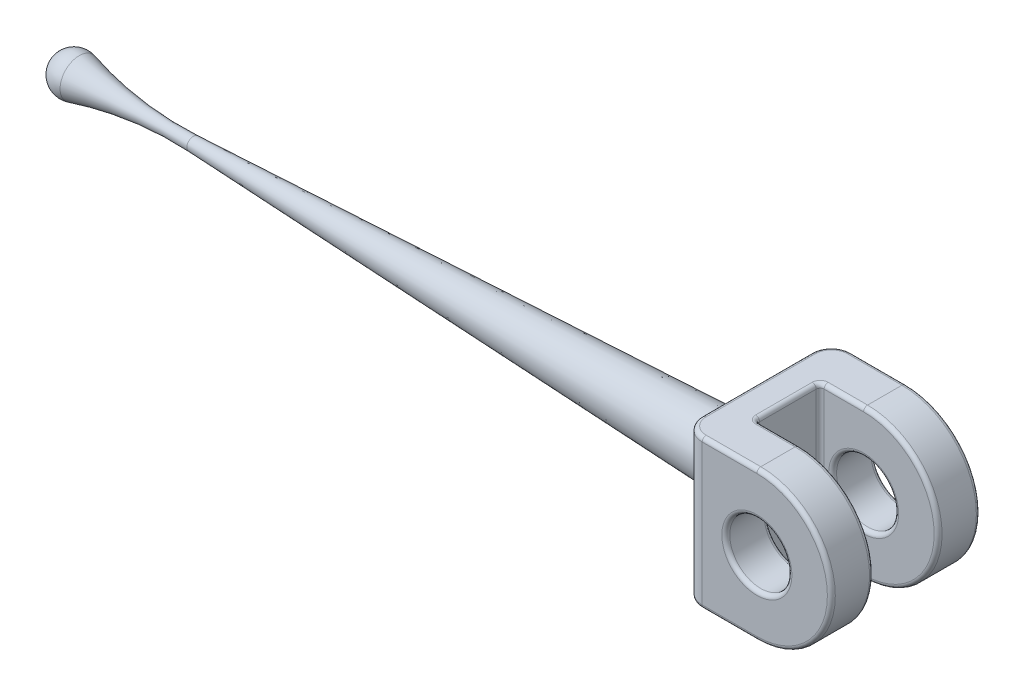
from build123d import *

# Parameters (mm, degrees)
SKETCH2_R               = 3.175
BOSS_EXTRUDE1_DEPTH     = 7.62
CUT_EXTRUDE1_DEPTH      = 81.229027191
CUT_EXTRUDE1_DEPTH_BACK = 81.229027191
FILLET1_R               = 2.032
FILLET2_R               = 0.4064


with BuildPart() as part:
    # Sketch2 → Boss-Extrude1 (new, symmetric)
    with BuildSketch(Plane.XY):
        with BuildLine():
            Line((0, -7.62), (-7.62, -7.62))
            Line((-7.62, -7.62), (-7.62, 7.62))
            Line((-7.62, 7.62), (0, 7.62))
            ThreePointArc((0, 7.62), (7.62, 0), (0, -7.62))
        make_face()
        with Locations(Location((0, 0, 0), (0, 0, 180))):
            Circle(SKETCH2_R, mode=Mode.SUBTRACT)
    extrude(amount=BOSS_EXTRUDE1_DEPTH, both=True)

    # Sketch3 → Revolve1 (revolve)
    with BuildSketch(Plane.XY):
        with BuildLine():
            Line((-7.62, 3.175), (-65.263580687, 0.658226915))
            ThreePointArc((-65.263580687, 0.658226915), (-71.150327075, 0.856931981), (-76.93610022, 1.96060578))
            ThreePointArc((-76.93610022, 1.96060578), (-78.703721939, 1.614606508), (-79.502, 0))
            Line((-79.502, 0), (-7.62, 0))
            Line((-7.62, 0), (-7.62, 3.175))
        make_face()
    revolve(axis=Axis((0, 0, 0), (-1, 0, 0)))

    # Sketch4 → Cut-Extrude1 (cut, two sides: drawn at the far end of the back side and taken through both)
    with BuildSketch(Plane(origin=(0, 0, 0), x_dir=(1, 0, 0), z_dir=(0, 1, 0)).offset(-CUT_EXTRUDE1_DEPTH_BACK)):
        with BuildLine():
            Line((-4.445, 3.302), (12.3825, 3.302))
            ThreePointArc((12.3825, 3.302), (14.178551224, 4.045948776), (14.9225, 5.842))
            Line((14.9225, 5.842), (14.9225, -5.842))
            ThreePointArc((14.9225, -5.842), (14.178551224, -4.045948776), (12.3825, -3.302))
            Line((12.3825, -3.302), (-4.445, -3.302))
            Line((-4.445, -3.302), (-4.445, 3.302))
        make_face()
    extrude(amount=CUT_EXTRUDE1_DEPTH + CUT_EXTRUDE1_DEPTH_BACK, mode=Mode.SUBTRACT)

    # Fillet1
    fillet1_edges = [part.edges().sort_by_distance(p)[0] for p in [
        (-7.62, -3.175, 0),
        (-7.62, 0, 7.62),
        (-7.62, 0, -7.62),
    ]]
    fillet(fillet1_edges, radius=FILLET1_R)

    # Fillet2
    fillet2_edges = [part.edges().sort_by_distance(p)[0] for p in [
        (7.62, 0, 7.62),
        (3.175, 0, -7.62),
        (3.175, 0, 7.62),
        (-2.794, 7.62, 7.62),
        (-2.2225, 7.62, 3.302),
        (-2.2225, 7.62, -3.302),
        (-4.445, 7.62, 0),
        (-2.2225, -7.62, 3.302),
        (7.62, 0, 3.302),
        (3.175, 0, 3.302),
        (7.62, 0, -3.302),
        (-2.2225, -7.62, -3.302),
        (-4.445, 0, -3.302),
        (3.175, 0, -3.302),
        (-4.445, 0, 3.302),
        (-4.445, -7.62, 0),
        (-2.794, 7.62, -7.62),
        (-7.62, -7.62, 0),
        (-7.62, 7.62, 0),
        (7.62, 0, -7.62),
        (-2.794, -7.62, 7.62),
        (-2.794, -7.62, -7.62),
        (-7.024840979, -7.62, 7.024840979),
        (-7.024840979, -7.62, -7.024840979),
        (-7.024840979, 7.62, 7.024840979),
        (-7.024840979, 7.62, -7.024840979),
    ]]
    fillet(fillet2_edges, radius=FILLET2_R)


solid = part.part
